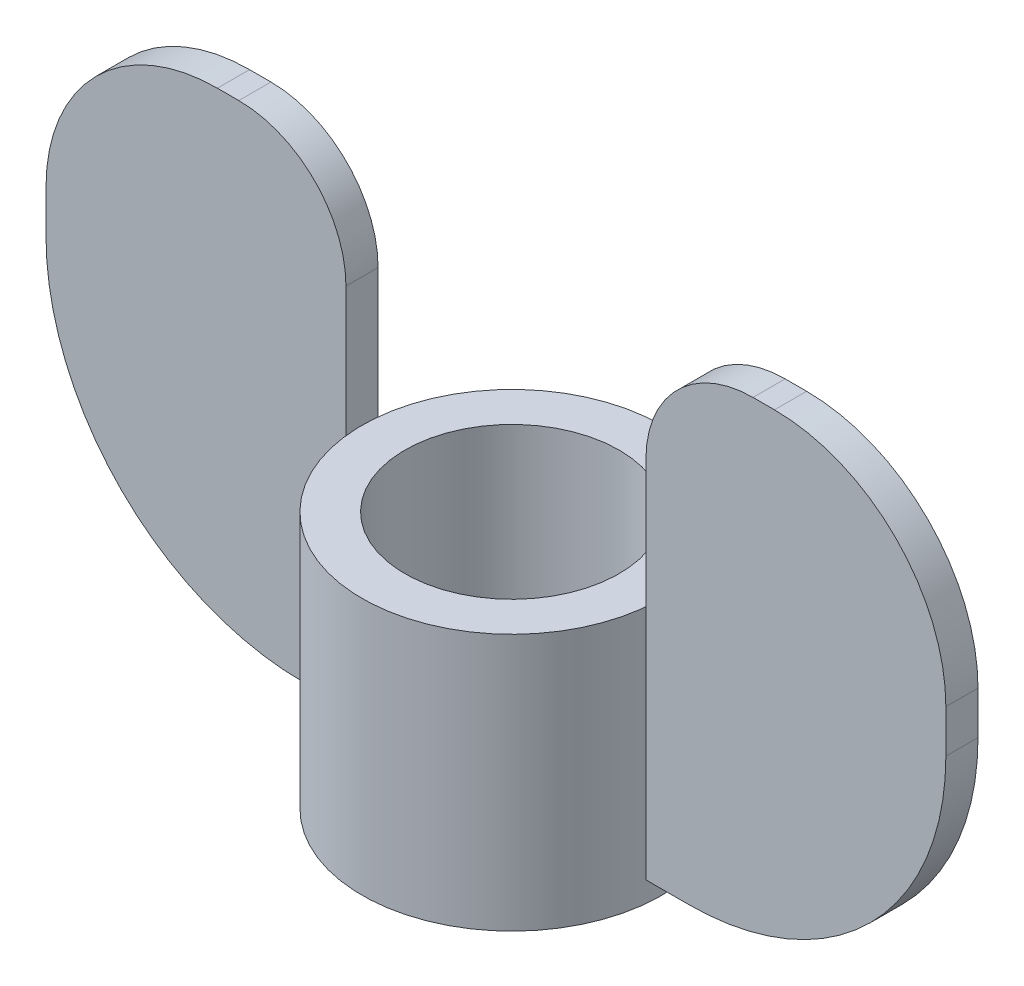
ISO-10303-21;
HEADER;
FILE_DESCRIPTION(('STEP AP214'),'2;1');
FILE_NAME('part.step','',(''),(''),'','','');
FILE_SCHEMA(('AUTOMOTIVE_DESIGN { 1 0 10303 214 1 1 1 1 }'));
ENDSEC;
DATA;
#1=APPLICATION_CONTEXT('core data for automotive mechanical design processes');
#2=APPLICATION_PROTOCOL_DEFINITION('international standard','automotive_design',2000,#1);
#3=PRODUCT_CONTEXT('',#1,'mechanical');
#4=PRODUCT('Part','Part','',(#3));
#5=PRODUCT_RELATED_PRODUCT_CATEGORY('part','',(#4));
#6=PRODUCT_DEFINITION_FORMATION('','',#4);
#7=PRODUCT_DEFINITION_CONTEXT('part definition',#1,'design');
#8=PRODUCT_DEFINITION('design','',#6,#7);
#9=PRODUCT_DEFINITION_SHAPE('','',#8);
#10=(LENGTH_UNIT() NAMED_UNIT(*) SI_UNIT(.MILLI.,.METRE.));
#11=(NAMED_UNIT(*) PLANE_ANGLE_UNIT() SI_UNIT($,.RADIAN.));
#12=(NAMED_UNIT(*) SI_UNIT($,.STERADIAN.) SOLID_ANGLE_UNIT());
#13=UNCERTAINTY_MEASURE_WITH_UNIT(LENGTH_MEASURE(1.E-05),#10,'distance_accuracy_value','');
#14=(GEOMETRIC_REPRESENTATION_CONTEXT(3) GLOBAL_UNCERTAINTY_ASSIGNED_CONTEXT((#13)) GLOBAL_UNIT_ASSIGNED_CONTEXT((#10,
#11,#12)) REPRESENTATION_CONTEXT('',''));
#15=CARTESIAN_POINT('',(0.,0.,0.));
#16=DIRECTION('',(0.,0.,1.));
#17=DIRECTION('',(1.,0.,0.));
#18=AXIS2_PLACEMENT_3D('',#15,#16,#17);
#19=CARTESIAN_POINT('',(23.,2.00000000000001,0.));
#20=DIRECTION('',(0.,0.,-1.));
#21=DIRECTION('',(-1.,0.,0.));
#22=AXIS2_PLACEMENT_3D('',#19,#20,#21);
#23=CYLINDRICAL_SURFACE('',#22,12.);
#24=DIRECTION('',(0.,0.,-1.));
#25=VECTOR('',#24,1.);
#26=CARTESIAN_POINT('',(35.,2.,0.));
#27=LINE('',#26,#25);
#28=CARTESIAN_POINT('',(35.,2.,1.5));
#29=VERTEX_POINT('',#28);
#30=CARTESIAN_POINT('',(35.,2.,0.));
#31=VERTEX_POINT('',#30);
#32=EDGE_CURVE('E150',#29,#31,#27,.T.);
#33=ORIENTED_EDGE('',*,*,#32,.F.);
#34=CARTESIAN_POINT('',(23.,2.00000000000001,1.5));
#35=DIRECTION('',(0.,0.,1.));
#36=DIRECTION('',(1.,0.,0.));
#37=AXIS2_PLACEMENT_3D('',#34,#35,#36);
#38=CIRCLE('',#37,12.);
#39=CARTESIAN_POINT('',(23.,-9.99999999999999,1.5));
#40=VERTEX_POINT('',#39);
#41=EDGE_CURVE('E49',#40,#29,#38,.T.);
#42=ORIENTED_EDGE('',*,*,#41,.F.);
#43=DIRECTION('',(0.,0.,-1.));
#44=VECTOR('',#43,1.);
#45=CARTESIAN_POINT('',(23.,-9.99999999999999,0.));
#46=LINE('',#45,#44);
#47=CARTESIAN_POINT('',(23.,-9.99999999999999,0.));
#48=VERTEX_POINT('',#47);
#49=EDGE_CURVE('E153',#48,#40,#46,.F.);
#50=ORIENTED_EDGE('',*,*,#49,.F.);
#51=CARTESIAN_POINT('',(23.,2.00000000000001,0.));
#52=DIRECTION('',(0.,0.,1.));
#53=DIRECTION('',(1.,0.,0.));
#54=AXIS2_PLACEMENT_3D('',#51,#52,#53);
#55=CIRCLE('',#54,12.);
#56=EDGE_CURVE('E12',#31,#48,#55,.F.);
#57=ORIENTED_EDGE('',*,*,#56,.F.);
#58=EDGE_LOOP('',(#33,#42,#50,#57));
#59=FACE_BOUND('',#58,.T.);
#60=ADVANCED_FACE('F42',(#59),#23,.T.);
#61=CARTESIAN_POINT('',(27.,4.00000000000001,0.));
#62=DIRECTION('',(0.,0.,1.));
#63=DIRECTION('',(1.,0.,0.));
#64=AXIS2_PLACEMENT_3D('',#61,#62,#63);
#65=CYLINDRICAL_SURFACE('',#64,8.);
#66=DIRECTION('',(0.,0.,1.));
#67=VECTOR('',#66,1.);
#68=CARTESIAN_POINT('',(35.,4.,0.));
#69=LINE('',#68,#67);
#70=CARTESIAN_POINT('',(35.,4.,0.));
#71=VERTEX_POINT('',#70);
#72=CARTESIAN_POINT('',(35.,4.,1.5));
#73=VERTEX_POINT('',#72);
#74=EDGE_CURVE('E140',#71,#73,#69,.T.);
#75=ORIENTED_EDGE('',*,*,#74,.F.);
#76=CARTESIAN_POINT('',(27.,4.00000000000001,0.));
#77=DIRECTION('',(0.,0.,1.));
#78=DIRECTION('',(1.,0.,0.));
#79=AXIS2_PLACEMENT_3D('',#76,#77,#78);
#80=CIRCLE('',#79,8.);
#81=CARTESIAN_POINT('',(27.,12.,0.));
#82=VERTEX_POINT('',#81);
#83=EDGE_CURVE('E146',#82,#71,#80,.F.);
#84=ORIENTED_EDGE('',*,*,#83,.F.);
#85=DIRECTION('',(0.,0.,1.));
#86=VECTOR('',#85,1.);
#87=CARTESIAN_POINT('',(27.,12.,0.));
#88=LINE('',#87,#86);
#89=CARTESIAN_POINT('',(27.,12.,1.5));
#90=VERTEX_POINT('',#89);
#91=EDGE_CURVE('E143',#90,#82,#88,.F.);
#92=ORIENTED_EDGE('',*,*,#91,.F.);
#93=CARTESIAN_POINT('',(27.,4.00000000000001,1.5));
#94=DIRECTION('',(0.,0.,1.));
#95=DIRECTION('',(1.,0.,0.));
#96=AXIS2_PLACEMENT_3D('',#93,#94,#95);
#97=CIRCLE('',#96,8.);
#98=EDGE_CURVE('E148',#73,#90,#97,.T.);
#99=ORIENTED_EDGE('',*,*,#98,.F.);
#100=EDGE_LOOP('',(#75,#84,#92,#99));
#101=FACE_BOUND('',#100,.T.);
#102=ADVANCED_FACE('F162',(#101),#65,.T.);
#103=CARTESIAN_POINT('',(26.,7.00000000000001,0.));
#104=DIRECTION('',(0.,0.,-1.));
#105=DIRECTION('',(-1.,0.,0.));
#106=AXIS2_PLACEMENT_3D('',#103,#104,#105);
#107=CYLINDRICAL_SURFACE('',#106,5.);
#108=DIRECTION('',(0.,0.,-1.));
#109=VECTOR('',#108,1.);
#110=CARTESIAN_POINT('',(21.,7.00000000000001,0.));
#111=LINE('',#110,#109);
#112=CARTESIAN_POINT('',(21.,7.00000000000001,1.5));
#113=VERTEX_POINT('',#112);
#114=CARTESIAN_POINT('',(21.,7.00000000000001,0.));
#115=VERTEX_POINT('',#114);
#116=EDGE_CURVE('E112',#113,#115,#111,.T.);
#117=ORIENTED_EDGE('',*,*,#116,.F.);
#118=CARTESIAN_POINT('',(26.,7.00000000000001,1.5));
#119=DIRECTION('',(0.,0.,1.));
#120=DIRECTION('',(1.,0.,0.));
#121=AXIS2_PLACEMENT_3D('',#118,#119,#120);
#122=CIRCLE('',#121,5.);
#123=CARTESIAN_POINT('',(26.,12.,1.5));
#124=VERTEX_POINT('',#123);
#125=EDGE_CURVE('E136',#124,#113,#122,.T.);
#126=ORIENTED_EDGE('',*,*,#125,.F.);
#127=DIRECTION('',(0.,0.,-1.));
#128=VECTOR('',#127,1.);
#129=CARTESIAN_POINT('',(26.,12.,0.));
#130=LINE('',#129,#128);
#131=CARTESIAN_POINT('',(26.,12.,0.));
#132=VERTEX_POINT('',#131);
#133=EDGE_CURVE('E133',#132,#124,#130,.F.);
#134=ORIENTED_EDGE('',*,*,#133,.F.);
#135=CARTESIAN_POINT('',(26.,7.00000000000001,0.));
#136=DIRECTION('',(0.,0.,1.));
#137=DIRECTION('',(1.,0.,0.));
#138=AXIS2_PLACEMENT_3D('',#135,#136,#137);
#139=CIRCLE('',#138,5.);
#140=EDGE_CURVE('E138',#115,#132,#139,.F.);
#141=ORIENTED_EDGE('',*,*,#140,.F.);
#142=EDGE_LOOP('',(#117,#126,#134,#141));
#143=FACE_BOUND('',#142,.T.);
#144=ADVANCED_FACE('F170',(#143),#107,.T.);
#145=CARTESIAN_POINT('',(35.,10.,0.));
#146=DIRECTION('',(-1.,0.,0.));
#147=DIRECTION('',(0.,1.,0.));
#148=AXIS2_PLACEMENT_3D('',#145,#146,#147);
#149=PLANE('',#148);
#150=DIRECTION('',(0.,-1.,0.));
#151=VECTOR('',#150,1.);
#152=CARTESIAN_POINT('',(35.,10.,1.5));
#153=LINE('',#152,#151);
#154=EDGE_CURVE('E123',#73,#29,#153,.T.);
#155=ORIENTED_EDGE('',*,*,#154,.T.);
#156=ORIENTED_EDGE('',*,*,#32,.T.);
#157=DIRECTION('',(0.,-1.,0.));
#158=VECTOR('',#157,1.);
#159=CARTESIAN_POINT('',(35.,10.,0.));
#160=LINE('',#159,#158);
#161=EDGE_CURVE('E102',#71,#31,#160,.T.);
#162=ORIENTED_EDGE('',*,*,#161,.F.);
#163=ORIENTED_EDGE('',*,*,#74,.T.);
#164=EDGE_LOOP('',(#155,#156,#162,#163));
#165=FACE_BOUND('',#164,.T.);
#166=ADVANCED_FACE('F159',(#165),#149,.F.);
#167=CARTESIAN_POINT('',(35.,-9.99999999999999,0.));
#168=DIRECTION('',(0.,1.,0.));
#169=DIRECTION('',(1.,0.,0.));
#170=AXIS2_PLACEMENT_3D('',#167,#168,#169);
#171=PLANE('',#170);
#172=DIRECTION('',(-1.,0.,0.));
#173=VECTOR('',#172,1.);
#174=CARTESIAN_POINT('',(35.,-9.99999999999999,0.));
#175=LINE('',#174,#173);
#176=CARTESIAN_POINT('',(21.,-9.99999999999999,0.));
#177=VERTEX_POINT('',#176);
#178=EDGE_CURVE('E96',#48,#177,#175,.T.);
#179=ORIENTED_EDGE('',*,*,#178,.F.);
#180=ORIENTED_EDGE('',*,*,#49,.T.);
#181=DIRECTION('',(-1.,0.,0.));
#182=VECTOR('',#181,1.);
#183=CARTESIAN_POINT('',(35.,-9.99999999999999,1.5));
#184=LINE('',#183,#182);
#185=CARTESIAN_POINT('',(21.,-9.99999999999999,1.5));
#186=VERTEX_POINT('',#185);
#187=EDGE_CURVE('E108',#40,#186,#184,.T.);
#188=ORIENTED_EDGE('',*,*,#187,.T.);
#189=DIRECTION('',(0.,0.,1.));
#190=VECTOR('',#189,1.);
#191=CARTESIAN_POINT('',(21.,-9.99999999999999,0.));
#192=LINE('',#191,#190);
#193=EDGE_CURVE('E105',#177,#186,#192,.T.);
#194=ORIENTED_EDGE('',*,*,#193,.F.);
#195=EDGE_LOOP('',(#179,#180,#188,#194));
#196=FACE_BOUND('',#195,.T.);
#197=ADVANCED_FACE('F106',(#196),#171,.F.);
#198=CARTESIAN_POINT('',(21.,10.,0.));
#199=DIRECTION('',(1.,0.,0.));
#200=DIRECTION('',(0.,0.,-1.));
#201=AXIS2_PLACEMENT_3D('',#198,#199,#200);
#202=PLANE('',#201);
#203=DIRECTION('',(0.,1.,0.));
#204=VECTOR('',#203,1.);
#205=CARTESIAN_POINT('',(21.,10.,1.5));
#206=LINE('',#205,#204);
#207=EDGE_CURVE('E127',#186,#113,#206,.T.);
#208=ORIENTED_EDGE('',*,*,#207,.T.);
#209=ORIENTED_EDGE('',*,*,#116,.T.);
#210=DIRECTION('',(0.,1.,0.));
#211=VECTOR('',#210,1.);
#212=CARTESIAN_POINT('',(21.,10.,0.));
#213=LINE('',#212,#211);
#214=EDGE_CURVE('E100',#177,#115,#213,.T.);
#215=ORIENTED_EDGE('',*,*,#214,.F.);
#216=ORIENTED_EDGE('',*,*,#193,.T.);
#217=EDGE_LOOP('',(#208,#209,#215,#216));
#218=FACE_BOUND('',#217,.T.);
#219=ADVANCED_FACE('F116',(#218),#202,.F.);
#220=CARTESIAN_POINT('',(35.,12.,0.));
#221=DIRECTION('',(0.,-1.,0.));
#222=DIRECTION('',(0.,0.,1.));
#223=AXIS2_PLACEMENT_3D('',#220,#221,#222);
#224=PLANE('',#223);
#225=DIRECTION('',(1.,0.,0.));
#226=VECTOR('',#225,1.);
#227=CARTESIAN_POINT('',(35.,12.,1.5));
#228=LINE('',#227,#226);
#229=EDGE_CURVE('E129',#124,#90,#228,.T.);
#230=ORIENTED_EDGE('',*,*,#229,.T.);
#231=ORIENTED_EDGE('',*,*,#91,.T.);
#232=DIRECTION('',(1.,0.,0.));
#233=VECTOR('',#232,1.);
#234=CARTESIAN_POINT('',(35.,12.,0.));
#235=LINE('',#234,#233);
#236=EDGE_CURVE('E113',#132,#82,#235,.T.);
#237=ORIENTED_EDGE('',*,*,#236,.F.);
#238=ORIENTED_EDGE('',*,*,#133,.T.);
#239=EDGE_LOOP('',(#230,#231,#237,#238));
#240=FACE_BOUND('',#239,.T.);
#241=ADVANCED_FACE('F166',(#240),#224,.F.);
#242=CARTESIAN_POINT('',(28.,0.,0.));
#243=DIRECTION('',(0.,0.,1.));
#244=DIRECTION('',(1.,0.,0.));
#245=AXIS2_PLACEMENT_3D('',#242,#243,#244);
#246=PLANE('',#245);
#247=ORIENTED_EDGE('',*,*,#161,.T.);
#248=ORIENTED_EDGE('',*,*,#56,.T.);
#249=ORIENTED_EDGE('',*,*,#178,.T.);
#250=ORIENTED_EDGE('',*,*,#214,.T.);
#251=ORIENTED_EDGE('',*,*,#140,.T.);
#252=ORIENTED_EDGE('',*,*,#236,.T.);
#253=ORIENTED_EDGE('',*,*,#83,.T.);
#254=EDGE_LOOP('',(#247,#248,#249,#250,#251,#252,#253));
#255=FACE_BOUND('',#254,.T.);
#256=ADVANCED_FACE('F98',(#255),#246,.F.);
#257=CARTESIAN_POINT('',(28.,0.,1.5));
#258=DIRECTION('',(0.,0.,1.));
#259=DIRECTION('',(1.,0.,0.));
#260=AXIS2_PLACEMENT_3D('',#257,#258,#259);
#261=PLANE('',#260);
#262=ORIENTED_EDGE('',*,*,#187,.F.);
#263=ORIENTED_EDGE('',*,*,#41,.T.);
#264=ORIENTED_EDGE('',*,*,#154,.F.);
#265=ORIENTED_EDGE('',*,*,#98,.T.);
#266=ORIENTED_EDGE('',*,*,#229,.F.);
#267=ORIENTED_EDGE('',*,*,#125,.T.);
#268=ORIENTED_EDGE('',*,*,#207,.F.);
#269=EDGE_LOOP('',(#262,#263,#264,#265,#266,#267,#268));
#270=FACE_BOUND('',#269,.T.);
#271=ADVANCED_FACE('F156',(#270),#261,.T.);
#272=CLOSED_SHELL('',(#60,#102,#144,#166,#197,#219,#241,#256,#271));
#273=MANIFOLD_SOLID_BREP('B2',#272);
#274=CARTESIAN_POINT('',(14.,-11.,0.75));
#275=DIRECTION('',(0.,-1.,0.));
#276=DIRECTION('',(0.,0.,-1.));
#277=AXIS2_PLACEMENT_3D('',#274,#275,#276);
#278=PLANE('',#277);
#279=CARTESIAN_POINT('',(14.,-11.,0.75));
#280=DIRECTION('',(0.,-1.,0.));
#281=DIRECTION('',(0.,0.,-1.));
#282=AXIS2_PLACEMENT_3D('',#279,#280,#281);
#283=CIRCLE('',#282,7.00000000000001);
#284=CARTESIAN_POINT('',(14.,-11.,-6.25000000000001));
#285=VERTEX_POINT('',#284);
#286=EDGE_CURVE('E41',#285,#285,#283,.T.);
#287=ORIENTED_EDGE('',*,*,#286,.T.);
#288=EDGE_LOOP('',(#287));
#289=FACE_BOUND('',#288,.T.);
#290=CARTESIAN_POINT('',(14.,-11.,0.75));
#291=DIRECTION('',(0.,-1.,0.));
#292=DIRECTION('',(0.,0.,-1.));
#293=AXIS2_PLACEMENT_3D('',#290,#291,#292);
#294=CIRCLE('',#293,5.);
#295=CARTESIAN_POINT('',(14.,-11.,-4.25));
#296=VERTEX_POINT('',#295);
#297=EDGE_CURVE('E266',#296,#296,#294,.T.);
#298=ORIENTED_EDGE('',*,*,#297,.F.);
#299=EDGE_LOOP('',(#298));
#300=FACE_BOUND('',#299,.T.);
#301=ADVANCED_FACE('F259',(#289,#300),#278,.T.);
#302=CARTESIAN_POINT('',(14.,-11.,0.75));
#303=DIRECTION('',(0.,1.,0.));
#304=DIRECTION('',(0.,0.,1.));
#305=AXIS2_PLACEMENT_3D('',#302,#303,#304);
#306=CYLINDRICAL_SURFACE('',#305,7.00000000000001);
#307=ORIENTED_EDGE('',*,*,#286,.F.);
#308=EDGE_LOOP('',(#307));
#309=FACE_BOUND('',#308,.T.);
#310=CARTESIAN_POINT('',(14.,1.,0.75));
#311=DIRECTION('',(0.,-1.,0.));
#312=DIRECTION('',(0.,0.,-1.));
#313=AXIS2_PLACEMENT_3D('',#310,#311,#312);
#314=CIRCLE('',#313,7.00000000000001);
#315=CARTESIAN_POINT('',(14.,1.,-6.25000000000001));
#316=VERTEX_POINT('',#315);
#317=EDGE_CURVE('E270',#316,#316,#314,.T.);
#318=ORIENTED_EDGE('',*,*,#317,.T.);
#319=EDGE_LOOP('',(#318));
#320=FACE_BOUND('',#319,.T.);
#321=ADVANCED_FACE('F261',(#309,#320),#306,.T.);
#322=CARTESIAN_POINT('',(14.,-11.,0.75));
#323=DIRECTION('',(0.,1.,0.));
#324=DIRECTION('',(0.,0.,1.));
#325=AXIS2_PLACEMENT_3D('',#322,#323,#324);
#326=CYLINDRICAL_SURFACE('',#325,5.);
#327=ORIENTED_EDGE('',*,*,#297,.T.);
#328=EDGE_LOOP('',(#327));
#329=FACE_BOUND('',#328,.T.);
#330=CARTESIAN_POINT('',(14.,1.,0.75));
#331=DIRECTION('',(0.,-1.,0.));
#332=DIRECTION('',(0.,0.,-1.));
#333=AXIS2_PLACEMENT_3D('',#330,#331,#332);
#334=CIRCLE('',#333,5.);
#335=CARTESIAN_POINT('',(14.,1.,-4.25));
#336=VERTEX_POINT('',#335);
#337=EDGE_CURVE('E274',#336,#336,#334,.T.);
#338=ORIENTED_EDGE('',*,*,#337,.F.);
#339=EDGE_LOOP('',(#338));
#340=FACE_BOUND('',#339,.T.);
#341=ADVANCED_FACE('F283',(#329,#340),#326,.F.);
#342=CARTESIAN_POINT('',(14.,1.,0.75));
#343=DIRECTION('',(0.,-1.,0.));
#344=DIRECTION('',(0.,0.,-1.));
#345=AXIS2_PLACEMENT_3D('',#342,#343,#344);
#346=PLANE('',#345);
#347=ORIENTED_EDGE('',*,*,#337,.T.);
#348=EDGE_LOOP('',(#347));
#349=FACE_BOUND('',#348,.T.);
#350=ORIENTED_EDGE('',*,*,#317,.F.);
#351=EDGE_LOOP('',(#350));
#352=FACE_BOUND('',#351,.T.);
#353=ADVANCED_FACE('F280',(#349,#352),#346,.F.);
#354=CLOSED_SHELL('',(#301,#321,#341,#353));
#355=MANIFOLD_SOLID_BREP('B6',#354);
#356=CARTESIAN_POINT('',(5.,2.00000000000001,1.5));
#357=DIRECTION('',(0.,0.,1.));
#358=DIRECTION('',(1.,0.,0.));
#359=AXIS2_PLACEMENT_3D('',#356,#357,#358);
#360=CYLINDRICAL_SURFACE('',#359,12.);
#361=DIRECTION('',(0.,0.,1.));
#362=VECTOR('',#361,1.);
#363=CARTESIAN_POINT('',(-7.,2.,1.5));
#364=LINE('',#363,#362);
#365=CARTESIAN_POINT('',(-7.,2.,0.));
#366=VERTEX_POINT('',#365);
#367=CARTESIAN_POINT('',(-7.,2.,1.5));
#368=VERTEX_POINT('',#367);
#369=EDGE_CURVE('E429',#366,#368,#364,.T.);
#370=ORIENTED_EDGE('',*,*,#369,.F.);
#371=CARTESIAN_POINT('',(5.,2.00000000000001,0.));
#372=DIRECTION('',(0.,0.,-1.));
#373=DIRECTION('',(-1.,0.,0.));
#374=AXIS2_PLACEMENT_3D('',#371,#372,#373);
#375=CIRCLE('',#374,12.);
#376=CARTESIAN_POINT('',(5.,-9.99999999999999,0.));
#377=VERTEX_POINT('',#376);
#378=EDGE_CURVE('E328',#377,#366,#375,.T.);
#379=ORIENTED_EDGE('',*,*,#378,.F.);
#380=DIRECTION('',(0.,0.,1.));
#381=VECTOR('',#380,1.);
#382=CARTESIAN_POINT('',(5.,-9.99999999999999,1.5));
#383=LINE('',#382,#381);
#384=CARTESIAN_POINT('',(5.,-9.99999999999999,1.5));
#385=VERTEX_POINT('',#384);
#386=EDGE_CURVE('E432',#385,#377,#383,.F.);
#387=ORIENTED_EDGE('',*,*,#386,.F.);
#388=CARTESIAN_POINT('',(5.,2.00000000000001,1.5));
#389=DIRECTION('',(0.,0.,-1.));
#390=DIRECTION('',(-1.,0.,0.));
#391=AXIS2_PLACEMENT_3D('',#388,#389,#390);
#392=CIRCLE('',#391,12.);
#393=EDGE_CURVE('E257',#368,#385,#392,.F.);
#394=ORIENTED_EDGE('',*,*,#393,.F.);
#395=EDGE_LOOP('',(#370,#379,#387,#394));
#396=FACE_BOUND('',#395,.T.);
#397=ADVANCED_FACE('F321',(#396),#360,.T.);
#398=CARTESIAN_POINT('',(1.,4.00000000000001,1.5));
#399=DIRECTION('',(0.,0.,-1.));
#400=DIRECTION('',(-1.,0.,0.));
#401=AXIS2_PLACEMENT_3D('',#398,#399,#400);
#402=CYLINDRICAL_SURFACE('',#401,8.);
#403=DIRECTION('',(0.,0.,-1.));
#404=VECTOR('',#403,1.);
#405=CARTESIAN_POINT('',(-7.,4.,1.5));
#406=LINE('',#405,#404);
#407=CARTESIAN_POINT('',(-7.,4.,1.5));
#408=VERTEX_POINT('',#407);
#409=CARTESIAN_POINT('',(-7.,4.,0.));
#410=VERTEX_POINT('',#409);
#411=EDGE_CURVE('E419',#408,#410,#406,.T.);
#412=ORIENTED_EDGE('',*,*,#411,.F.);
#413=CARTESIAN_POINT('',(1.,4.00000000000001,1.5));
#414=DIRECTION('',(0.,0.,-1.));
#415=DIRECTION('',(-1.,0.,0.));
#416=AXIS2_PLACEMENT_3D('',#413,#414,#415);
#417=CIRCLE('',#416,8.);
#418=CARTESIAN_POINT('',(1.,12.,1.5));
#419=VERTEX_POINT('',#418);
#420=EDGE_CURVE('E425',#419,#408,#417,.F.);
#421=ORIENTED_EDGE('',*,*,#420,.F.);
#422=DIRECTION('',(0.,0.,-1.));
#423=VECTOR('',#422,1.);
#424=CARTESIAN_POINT('',(1.,12.,1.5));
#425=LINE('',#424,#423);
#426=CARTESIAN_POINT('',(1.,12.,0.));
#427=VERTEX_POINT('',#426);
#428=EDGE_CURVE('E422',#427,#419,#425,.F.);
#429=ORIENTED_EDGE('',*,*,#428,.F.);
#430=CARTESIAN_POINT('',(1.,4.00000000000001,0.));
#431=DIRECTION('',(0.,0.,-1.));
#432=DIRECTION('',(-1.,0.,0.));
#433=AXIS2_PLACEMENT_3D('',#430,#431,#432);
#434=CIRCLE('',#433,8.);
#435=EDGE_CURVE('E427',#410,#427,#434,.T.);
#436=ORIENTED_EDGE('',*,*,#435,.F.);
#437=EDGE_LOOP('',(#412,#421,#429,#436));
#438=FACE_BOUND('',#437,.T.);
#439=ADVANCED_FACE('F441',(#438),#402,.T.);
#440=CARTESIAN_POINT('',(2.,7.00000000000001,1.5));
#441=DIRECTION('',(0.,0.,1.));
#442=DIRECTION('',(1.,0.,0.));
#443=AXIS2_PLACEMENT_3D('',#440,#441,#442);
#444=CYLINDRICAL_SURFACE('',#443,5.);
#445=DIRECTION('',(0.,0.,1.));
#446=VECTOR('',#445,1.);
#447=CARTESIAN_POINT('',(7.,7.00000000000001,1.5));
#448=LINE('',#447,#446);
#449=CARTESIAN_POINT('',(7.,7.00000000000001,0.));
#450=VERTEX_POINT('',#449);
#451=CARTESIAN_POINT('',(7.,7.00000000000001,1.5));
#452=VERTEX_POINT('',#451);
#453=EDGE_CURVE('E391',#450,#452,#448,.T.);
#454=ORIENTED_EDGE('',*,*,#453,.F.);
#455=CARTESIAN_POINT('',(2.,7.00000000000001,0.));
#456=DIRECTION('',(0.,0.,-1.));
#457=DIRECTION('',(-1.,0.,0.));
#458=AXIS2_PLACEMENT_3D('',#455,#456,#457);
#459=CIRCLE('',#458,5.);
#460=CARTESIAN_POINT('',(2.,12.,0.));
#461=VERTEX_POINT('',#460);
#462=EDGE_CURVE('E415',#461,#450,#459,.T.);
#463=ORIENTED_EDGE('',*,*,#462,.F.);
#464=DIRECTION('',(0.,0.,1.));
#465=VECTOR('',#464,1.);
#466=CARTESIAN_POINT('',(2.,12.,1.5));
#467=LINE('',#466,#465);
#468=CARTESIAN_POINT('',(2.,12.,1.5));
#469=VERTEX_POINT('',#468);
#470=EDGE_CURVE('E412',#469,#461,#467,.F.);
#471=ORIENTED_EDGE('',*,*,#470,.F.);
#472=CARTESIAN_POINT('',(2.,7.00000000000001,1.5));
#473=DIRECTION('',(0.,0.,-1.));
#474=DIRECTION('',(-1.,0.,0.));
#475=AXIS2_PLACEMENT_3D('',#472,#473,#474);
#476=CIRCLE('',#475,5.);
#477=EDGE_CURVE('E417',#452,#469,#476,.F.);
#478=ORIENTED_EDGE('',*,*,#477,.F.);
#479=EDGE_LOOP('',(#454,#463,#471,#478));
#480=FACE_BOUND('',#479,.T.);
#481=ADVANCED_FACE('F449',(#480),#444,.T.);
#482=CARTESIAN_POINT('',(-7.,10.,1.5));
#483=DIRECTION('',(1.,0.,0.));
#484=DIRECTION('',(0.,1.,0.));
#485=AXIS2_PLACEMENT_3D('',#482,#483,#484);
#486=PLANE('',#485);
#487=DIRECTION('',(0.,-1.,0.));
#488=VECTOR('',#487,1.);
#489=CARTESIAN_POINT('',(-7.,10.,0.));
#490=LINE('',#489,#488);
#491=EDGE_CURVE('E402',#410,#366,#490,.T.);
#492=ORIENTED_EDGE('',*,*,#491,.T.);
#493=ORIENTED_EDGE('',*,*,#369,.T.);
#494=DIRECTION('',(0.,-1.,0.));
#495=VECTOR('',#494,1.);
#496=CARTESIAN_POINT('',(-7.,10.,1.5));
#497=LINE('',#496,#495);
#498=EDGE_CURVE('E381',#408,#368,#497,.T.);
#499=ORIENTED_EDGE('',*,*,#498,.F.);
#500=ORIENTED_EDGE('',*,*,#411,.T.);
#501=EDGE_LOOP('',(#492,#493,#499,#500));
#502=FACE_BOUND('',#501,.T.);
#503=ADVANCED_FACE('F438',(#502),#486,.F.);
#504=CARTESIAN_POINT('',(-7.,-9.99999999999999,1.5));
#505=DIRECTION('',(0.,1.,0.));
#506=DIRECTION('',(-1.,0.,0.));
#507=AXIS2_PLACEMENT_3D('',#504,#505,#506);
#508=PLANE('',#507);
#509=DIRECTION('',(1.,0.,0.));
#510=VECTOR('',#509,1.);
#511=CARTESIAN_POINT('',(-7.,-9.99999999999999,1.5));
#512=LINE('',#511,#510);
#513=CARTESIAN_POINT('',(7.,-9.99999999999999,1.5));
#514=VERTEX_POINT('',#513);
#515=EDGE_CURVE('E375',#385,#514,#512,.T.);
#516=ORIENTED_EDGE('',*,*,#515,.F.);
#517=ORIENTED_EDGE('',*,*,#386,.T.);
#518=DIRECTION('',(1.,0.,0.));
#519=VECTOR('',#518,1.);
#520=CARTESIAN_POINT('',(-7.,-9.99999999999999,0.));
#521=LINE('',#520,#519);
#522=CARTESIAN_POINT('',(7.,-9.99999999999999,0.));
#523=VERTEX_POINT('',#522);
#524=EDGE_CURVE('E387',#377,#523,#521,.T.);
#525=ORIENTED_EDGE('',*,*,#524,.T.);
#526=DIRECTION('',(0.,0.,-1.));
#527=VECTOR('',#526,1.);
#528=CARTESIAN_POINT('',(7.,-9.99999999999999,1.5));
#529=LINE('',#528,#527);
#530=EDGE_CURVE('E384',#514,#523,#529,.T.);
#531=ORIENTED_EDGE('',*,*,#530,.F.);
#532=EDGE_LOOP('',(#516,#517,#525,#531));
#533=FACE_BOUND('',#532,.T.);
#534=ADVANCED_FACE('F385',(#533),#508,.F.);
#535=CARTESIAN_POINT('',(7.,10.,1.5));
#536=DIRECTION('',(-1.,0.,0.));
#537=DIRECTION('',(0.,0.,1.));
#538=AXIS2_PLACEMENT_3D('',#535,#536,#537);
#539=PLANE('',#538);
#540=DIRECTION('',(0.,1.,0.));
#541=VECTOR('',#540,1.);
#542=CARTESIAN_POINT('',(7.,10.,0.));
#543=LINE('',#542,#541);
#544=EDGE_CURVE('E406',#523,#450,#543,.T.);
#545=ORIENTED_EDGE('',*,*,#544,.T.);
#546=ORIENTED_EDGE('',*,*,#453,.T.);
#547=DIRECTION('',(0.,1.,0.));
#548=VECTOR('',#547,1.);
#549=CARTESIAN_POINT('',(7.,10.,1.5));
#550=LINE('',#549,#548);
#551=EDGE_CURVE('E379',#514,#452,#550,.T.);
#552=ORIENTED_EDGE('',*,*,#551,.F.);
#553=ORIENTED_EDGE('',*,*,#530,.T.);
#554=EDGE_LOOP('',(#545,#546,#552,#553));
#555=FACE_BOUND('',#554,.T.);
#556=ADVANCED_FACE('F395',(#555),#539,.F.);
#557=CARTESIAN_POINT('',(-7.,12.,1.5));
#558=DIRECTION('',(0.,-1.,0.));
#559=DIRECTION('',(0.,0.,-1.));
#560=AXIS2_PLACEMENT_3D('',#557,#558,#559);
#561=PLANE('',#560);
#562=DIRECTION('',(-1.,0.,0.));
#563=VECTOR('',#562,1.);
#564=CARTESIAN_POINT('',(-7.,12.,0.));
#565=LINE('',#564,#563);
#566=EDGE_CURVE('E408',#461,#427,#565,.T.);
#567=ORIENTED_EDGE('',*,*,#566,.T.);
#568=ORIENTED_EDGE('',*,*,#428,.T.);
#569=DIRECTION('',(-1.,0.,0.));
#570=VECTOR('',#569,1.);
#571=CARTESIAN_POINT('',(-7.,12.,1.5));
#572=LINE('',#571,#570);
#573=EDGE_CURVE('E392',#469,#419,#572,.T.);
#574=ORIENTED_EDGE('',*,*,#573,.F.);
#575=ORIENTED_EDGE('',*,*,#470,.T.);
#576=EDGE_LOOP('',(#567,#568,#574,#575));
#577=FACE_BOUND('',#576,.T.);
#578=ADVANCED_FACE('F445',(#577),#561,.F.);
#579=CARTESIAN_POINT('',(0.,0.,1.5));
#580=DIRECTION('',(0.,0.,-1.));
#581=DIRECTION('',(-1.,0.,0.));
#582=AXIS2_PLACEMENT_3D('',#579,#580,#581);
#583=PLANE('',#582);
#584=ORIENTED_EDGE('',*,*,#498,.T.);
#585=ORIENTED_EDGE('',*,*,#393,.T.);
#586=ORIENTED_EDGE('',*,*,#515,.T.);
#587=ORIENTED_EDGE('',*,*,#551,.T.);
#588=ORIENTED_EDGE('',*,*,#477,.T.);
#589=ORIENTED_EDGE('',*,*,#573,.T.);
#590=ORIENTED_EDGE('',*,*,#420,.T.);
#591=EDGE_LOOP('',(#584,#585,#586,#587,#588,#589,#590));
#592=FACE_BOUND('',#591,.T.);
#593=ADVANCED_FACE('F377',(#592),#583,.F.);
#594=CARTESIAN_POINT('',(0.,0.,0.));
#595=DIRECTION('',(0.,0.,-1.));
#596=DIRECTION('',(-1.,0.,0.));
#597=AXIS2_PLACEMENT_3D('',#594,#595,#596);
#598=PLANE('',#597);
#599=ORIENTED_EDGE('',*,*,#524,.F.);
#600=ORIENTED_EDGE('',*,*,#378,.T.);
#601=ORIENTED_EDGE('',*,*,#491,.F.);
#602=ORIENTED_EDGE('',*,*,#435,.T.);
#603=ORIENTED_EDGE('',*,*,#566,.F.);
#604=ORIENTED_EDGE('',*,*,#462,.T.);
#605=ORIENTED_EDGE('',*,*,#544,.F.);
#606=EDGE_LOOP('',(#599,#600,#601,#602,#603,#604,#605));
#607=FACE_BOUND('',#606,.T.);
#608=ADVANCED_FACE('F435',(#607),#598,.T.);
#609=CLOSED_SHELL('',(#397,#439,#481,#503,#534,#556,#578,#593,#608));
#610=MANIFOLD_SOLID_BREP('B36',#609);
#611=ADVANCED_BREP_SHAPE_REPRESENTATION('',(#18,#273,#355,#610),#14);
#612=SHAPE_DEFINITION_REPRESENTATION(#9,#611);
ENDSEC;
END-ISO-10303-21;
